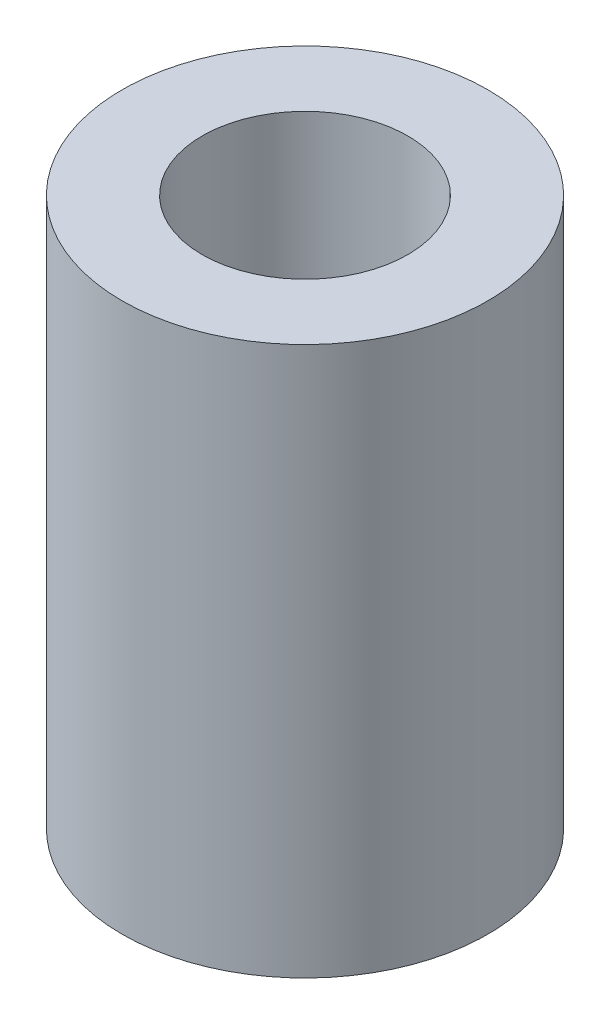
ISO-10303-21;
HEADER;
FILE_DESCRIPTION(('STEP AP214'),'2;1');
FILE_NAME('part.step','',(''),(''),'','','');
FILE_SCHEMA(('AUTOMOTIVE_DESIGN { 1 0 10303 214 1 1 1 1 }'));
ENDSEC;
DATA;
#1=APPLICATION_CONTEXT('core data for automotive mechanical design processes');
#2=APPLICATION_PROTOCOL_DEFINITION('international standard','automotive_design',2000,#1);
#3=PRODUCT_CONTEXT('',#1,'mechanical');
#4=PRODUCT('Part','Part','',(#3));
#5=PRODUCT_RELATED_PRODUCT_CATEGORY('part','',(#4));
#6=PRODUCT_DEFINITION_FORMATION('','',#4);
#7=PRODUCT_DEFINITION_CONTEXT('part definition',#1,'design');
#8=PRODUCT_DEFINITION('design','',#6,#7);
#9=PRODUCT_DEFINITION_SHAPE('','',#8);
#10=(LENGTH_UNIT() NAMED_UNIT(*) SI_UNIT(.MILLI.,.METRE.));
#11=(NAMED_UNIT(*) PLANE_ANGLE_UNIT() SI_UNIT($,.RADIAN.));
#12=(NAMED_UNIT(*) SI_UNIT($,.STERADIAN.) SOLID_ANGLE_UNIT());
#13=UNCERTAINTY_MEASURE_WITH_UNIT(LENGTH_MEASURE(1.E-05),#10,'distance_accuracy_value','');
#14=(GEOMETRIC_REPRESENTATION_CONTEXT(3) GLOBAL_UNCERTAINTY_ASSIGNED_CONTEXT((#13)) GLOBAL_UNIT_ASSIGNED_CONTEXT((#10,
#11,#12)) REPRESENTATION_CONTEXT('',''));
#15=CARTESIAN_POINT('',(0.,0.,0.));
#16=DIRECTION('',(0.,0.,1.));
#17=DIRECTION('',(1.,0.,0.));
#18=AXIS2_PLACEMENT_3D('',#15,#16,#17);
#19=CARTESIAN_POINT('',(0.,12.,0.));
#20=DIRECTION('',(0.,1.,0.));
#21=DIRECTION('',(0.,0.,1.));
#22=AXIS2_PLACEMENT_3D('',#19,#20,#21);
#23=PLANE('',#22);
#24=CARTESIAN_POINT('',(0.,12.,0.));
#25=DIRECTION('',(0.,1.,0.));
#26=DIRECTION('',(0.,0.,1.));
#27=AXIS2_PLACEMENT_3D('',#24,#25,#26);
#28=CIRCLE('',#27,4.);
#29=CARTESIAN_POINT('',(0.,12.,4.));
#30=VERTEX_POINT('',#29);
#31=EDGE_CURVE('E10',#30,#30,#28,.T.);
#32=ORIENTED_EDGE('',*,*,#31,.T.);
#33=EDGE_LOOP('',(#32));
#34=FACE_BOUND('',#33,.T.);
#35=CARTESIAN_POINT('',(0.,12.,0.));
#36=DIRECTION('',(0.,1.,0.));
#37=DIRECTION('',(0.,0.,1.));
#38=AXIS2_PLACEMENT_3D('',#35,#36,#37);
#39=CIRCLE('',#38,2.25);
#40=CARTESIAN_POINT('',(0.,12.,2.25));
#41=VERTEX_POINT('',#40);
#42=EDGE_CURVE('E40',#41,#41,#39,.T.);
#43=ORIENTED_EDGE('',*,*,#42,.F.);
#44=EDGE_LOOP('',(#43));
#45=FACE_BOUND('',#44,.T.);
#46=ADVANCED_FACE('F29',(#34,#45),#23,.T.);
#47=CARTESIAN_POINT('',(0.,0.,0.));
#48=DIRECTION('',(0.,1.,0.));
#49=DIRECTION('',(0.,0.,1.));
#50=AXIS2_PLACEMENT_3D('',#47,#48,#49);
#51=PLANE('',#50);
#52=CARTESIAN_POINT('',(0.,0.,0.));
#53=DIRECTION('',(0.,1.,0.));
#54=DIRECTION('',(0.,0.,1.));
#55=AXIS2_PLACEMENT_3D('',#52,#53,#54);
#56=CIRCLE('',#55,4.);
#57=CARTESIAN_POINT('',(0.,0.,4.));
#58=VERTEX_POINT('',#57);
#59=EDGE_CURVE('E33',#58,#58,#56,.T.);
#60=ORIENTED_EDGE('',*,*,#59,.F.);
#61=EDGE_LOOP('',(#60));
#62=FACE_BOUND('',#61,.T.);
#63=CARTESIAN_POINT('',(0.,0.,0.));
#64=DIRECTION('',(0.,1.,0.));
#65=DIRECTION('',(0.,0.,1.));
#66=AXIS2_PLACEMENT_3D('',#63,#64,#65);
#67=CIRCLE('',#66,2.25);
#68=CARTESIAN_POINT('',(0.,0.,2.25));
#69=VERTEX_POINT('',#68);
#70=EDGE_CURVE('E42',#69,#69,#67,.T.);
#71=ORIENTED_EDGE('',*,*,#70,.T.);
#72=EDGE_LOOP('',(#71));
#73=FACE_BOUND('',#72,.T.);
#74=ADVANCED_FACE('F52',(#62,#73),#51,.F.);
#75=CARTESIAN_POINT('',(0.,12.,0.));
#76=DIRECTION('',(0.,-1.,0.));
#77=DIRECTION('',(0.,0.,-1.));
#78=AXIS2_PLACEMENT_3D('',#75,#76,#77);
#79=CYLINDRICAL_SURFACE('',#78,4.);
#80=ORIENTED_EDGE('',*,*,#31,.F.);
#81=EDGE_LOOP('',(#80));
#82=FACE_BOUND('',#81,.T.);
#83=ORIENTED_EDGE('',*,*,#59,.T.);
#84=EDGE_LOOP('',(#83));
#85=FACE_BOUND('',#84,.T.);
#86=ADVANCED_FACE('F31',(#82,#85),#79,.T.);
#87=CARTESIAN_POINT('',(0.,12.,0.));
#88=DIRECTION('',(0.,-1.,0.));
#89=DIRECTION('',(0.,0.,-1.));
#90=AXIS2_PLACEMENT_3D('',#87,#88,#89);
#91=CYLINDRICAL_SURFACE('',#90,2.25);
#92=ORIENTED_EDGE('',*,*,#42,.T.);
#93=EDGE_LOOP('',(#92));
#94=FACE_BOUND('',#93,.T.);
#95=ORIENTED_EDGE('',*,*,#70,.F.);
#96=EDGE_LOOP('',(#95));
#97=FACE_BOUND('',#96,.T.);
#98=ADVANCED_FACE('F48',(#94,#97),#91,.F.);
#99=CLOSED_SHELL('',(#46,#74,#86,#98));
#100=MANIFOLD_SOLID_BREP('B2',#99);
#101=ADVANCED_BREP_SHAPE_REPRESENTATION('',(#18,#100),#14);
#102=SHAPE_DEFINITION_REPRESENTATION(#9,#101);
ENDSEC;
END-ISO-10303-21;
